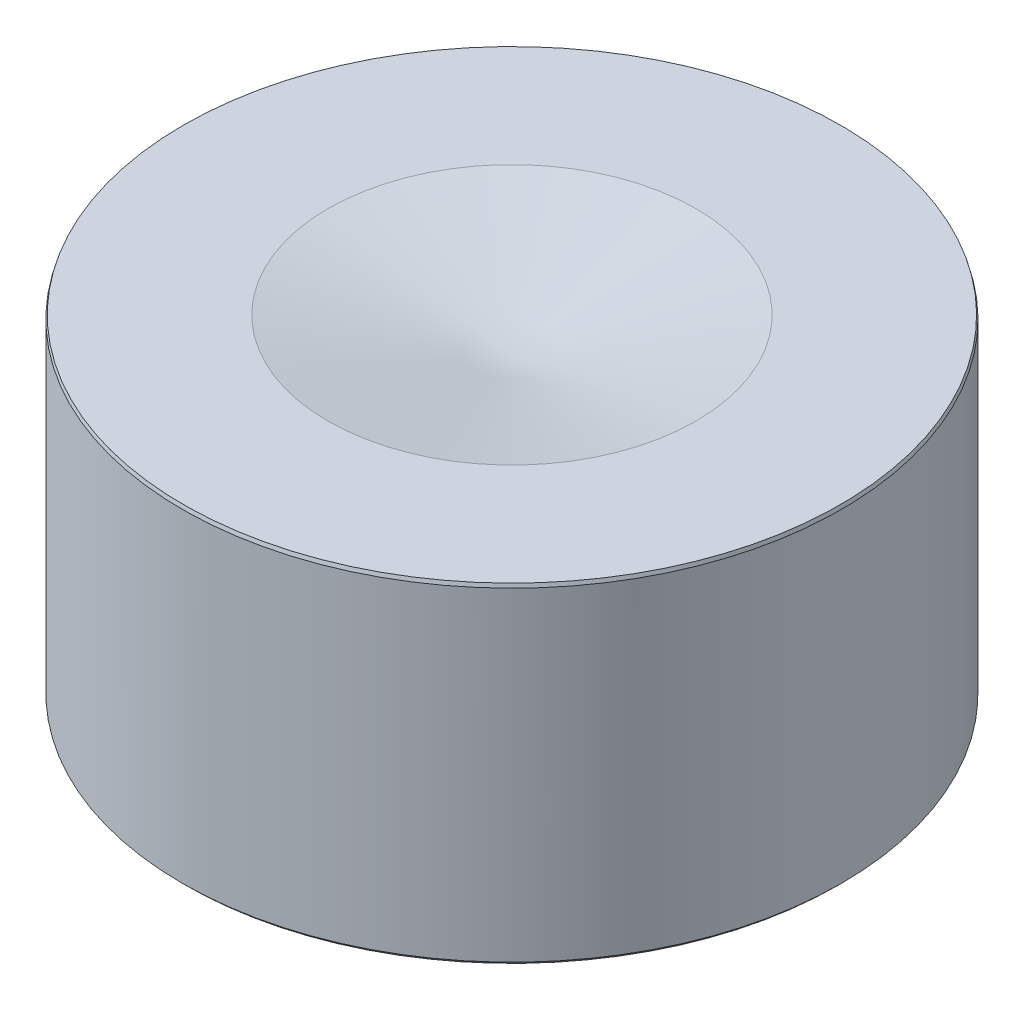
from build123d import *

# Parameters (mm, degrees)
CHAMFER1_SIZE  = 0.1
FILLET1_R      = 0.3
CHAMFER2_SIZE  = 0.1
CHAMFER2_SIZE2 = 0.026794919


with BuildPart() as part:
    # Sketch1 → Revolve1 (revolve)
    with BuildSketch(Plane.XY):
        Polygon((-8.955, 0), (-8.955, 9), (-5, 9), (0, 8), (0, 6), (-7.5, 6), (-7.5, 0), align=None)
    revolve(axis=Axis((0, 8, 0), (0, -1, 0)))

    # Chamfer1
    chamfer1_edges = [part.edges().sort_by_distance(p)[0] for p in [
        (7.5, 0, 0),
        (8.955, 0, 0),
    ]]
    chamfer(chamfer1_edges, length=CHAMFER1_SIZE)

    # Fillet1
    fillet1_edges = [part.edges().sort_by_distance(p)[0] for p in [
        (7.5, 6, 0),
    ]]
    fillet(fillet1_edges, radius=FILLET1_R)

    # Chamfer2
    chamfer2_edges = [part.edges().sort_by_distance(p)[0] for p in [
        (8.955, 9, 0),
    ]]
    chamfer2_side = [part.faces().sort_by_distance(p)[0] for p in [
        (8.955, 4.55, 0),
    ]]
    chamfer(chamfer2_edges, length=CHAMFER2_SIZE, length2=CHAMFER2_SIZE2, reference=chamfer2_side[0])


solid = part.part
